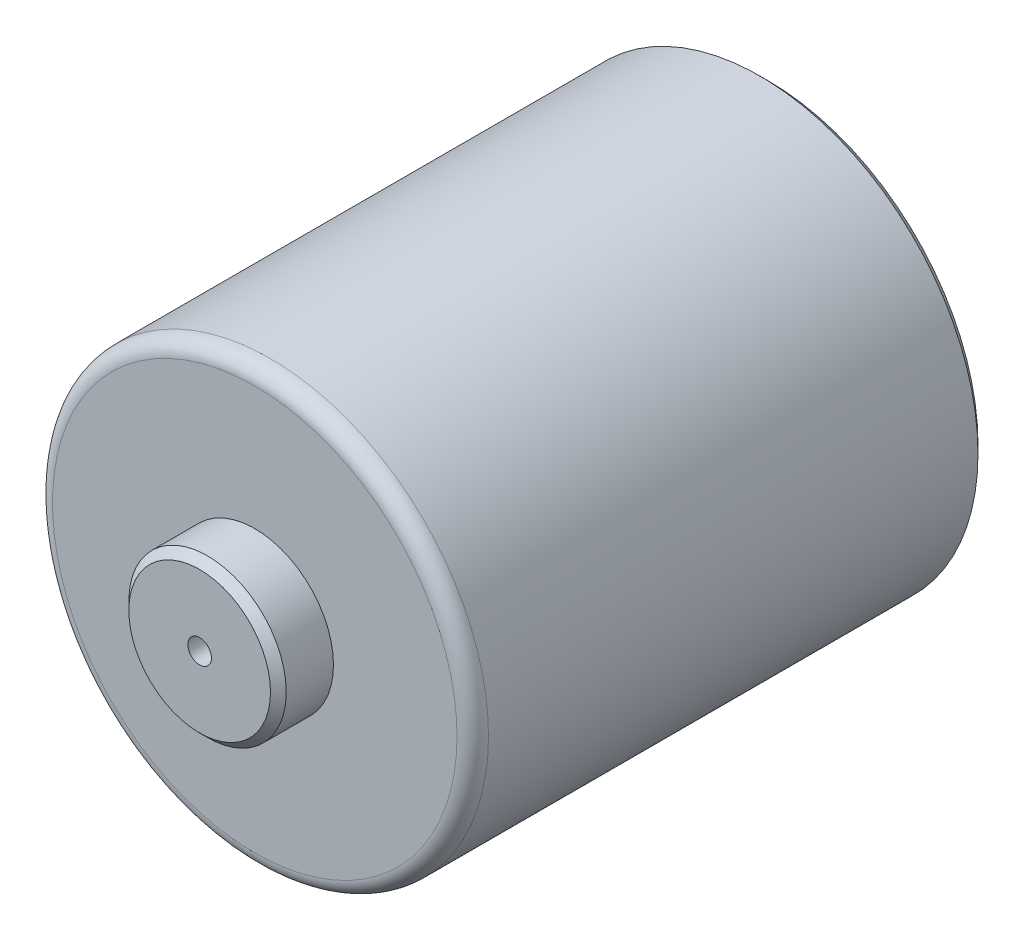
ISO-10303-21;
HEADER;
FILE_DESCRIPTION(('STEP AP214'),'2;1');
FILE_NAME('part.step','',(''),(''),'','','');
FILE_SCHEMA(('AUTOMOTIVE_DESIGN { 1 0 10303 214 1 1 1 1 }'));
ENDSEC;
DATA;
#1=APPLICATION_CONTEXT('core data for automotive mechanical design processes');
#2=APPLICATION_PROTOCOL_DEFINITION('international standard','automotive_design',2000,#1);
#3=PRODUCT_CONTEXT('',#1,'mechanical');
#4=PRODUCT('Part','Part','',(#3));
#5=PRODUCT_RELATED_PRODUCT_CATEGORY('part','',(#4));
#6=PRODUCT_DEFINITION_FORMATION('','',#4);
#7=PRODUCT_DEFINITION_CONTEXT('part definition',#1,'design');
#8=PRODUCT_DEFINITION('design','',#6,#7);
#9=PRODUCT_DEFINITION_SHAPE('','',#8);
#10=(LENGTH_UNIT() NAMED_UNIT(*) SI_UNIT(.MILLI.,.METRE.));
#11=(NAMED_UNIT(*) PLANE_ANGLE_UNIT() SI_UNIT($,.RADIAN.));
#12=(NAMED_UNIT(*) SI_UNIT($,.STERADIAN.) SOLID_ANGLE_UNIT());
#13=UNCERTAINTY_MEASURE_WITH_UNIT(LENGTH_MEASURE(1.E-05),#10,'distance_accuracy_value','');
#14=(GEOMETRIC_REPRESENTATION_CONTEXT(3) GLOBAL_UNCERTAINTY_ASSIGNED_CONTEXT((#13)) GLOBAL_UNIT_ASSIGNED_CONTEXT((#10,
#11,#12)) REPRESENTATION_CONTEXT('',''));
#15=CARTESIAN_POINT('',(0.,0.,0.));
#16=DIRECTION('',(0.,0.,1.));
#17=DIRECTION('',(1.,0.,0.));
#18=AXIS2_PLACEMENT_3D('',#15,#16,#17);
#19=CARTESIAN_POINT('',(0.,0.,0.));
#20=DIRECTION('',(0.,0.,1.));
#21=DIRECTION('',(1.,0.,0.));
#22=AXIS2_PLACEMENT_3D('',#19,#20,#21);
#23=PLANE('',#22);
#24=CARTESIAN_POINT('',(0.,0.,0.));
#25=DIRECTION('',(0.,0.,1.));
#26=DIRECTION('',(1.,0.,0.));
#27=AXIS2_PLACEMENT_3D('',#24,#25,#26);
#28=CIRCLE('',#27,13.35);
#29=CARTESIAN_POINT('',(13.35,0.,0.));
#30=VERTEX_POINT('',#29);
#31=EDGE_CURVE('E50',#30,#30,#28,.F.);
#32=ORIENTED_EDGE('',*,*,#31,.T.);
#33=EDGE_LOOP('',(#32));
#34=FACE_BOUND('',#33,.T.);
#35=CARTESIAN_POINT('',(0.,0.,0.));
#36=DIRECTION('',(0.,0.,1.));
#37=DIRECTION('',(1.,0.,0.));
#38=AXIS2_PLACEMENT_3D('',#35,#36,#37);
#39=CIRCLE('',#38,5.);
#40=CARTESIAN_POINT('',(5.,0.,0.));
#41=VERTEX_POINT('',#40);
#42=EDGE_CURVE('E62',#41,#41,#39,.F.);
#43=ORIENTED_EDGE('',*,*,#42,.F.);
#44=EDGE_LOOP('',(#43));
#45=FACE_BOUND('',#44,.T.);
#46=ADVANCED_FACE('F30',(#34,#45),#23,.F.);
#47=CARTESIAN_POINT('',(0.,0.,32.6));
#48=DIRECTION('',(0.,0.,1.));
#49=DIRECTION('',(1.,0.,0.));
#50=AXIS2_PLACEMENT_3D('',#47,#48,#49);
#51=PLANE('',#50);
#52=CARTESIAN_POINT('',(0.,0.,32.6));
#53=DIRECTION('',(0.,0.,1.));
#54=DIRECTION('',(1.,0.,0.));
#55=AXIS2_PLACEMENT_3D('',#52,#53,#54);
#56=CIRCLE('',#55,12.85);
#57=CARTESIAN_POINT('',(12.85,0.,32.6));
#58=VERTEX_POINT('',#57);
#59=EDGE_CURVE('E37',#58,#58,#56,.T.);
#60=ORIENTED_EDGE('',*,*,#59,.T.);
#61=EDGE_LOOP('',(#60));
#62=FACE_BOUND('',#61,.T.);
#63=CARTESIAN_POINT('',(0.,0.,32.6));
#64=DIRECTION('',(0.,0.,1.));
#65=DIRECTION('',(1.,0.,0.));
#66=AXIS2_PLACEMENT_3D('',#63,#64,#65);
#67=CIRCLE('',#66,5.);
#68=CARTESIAN_POINT('',(5.,0.,32.6));
#69=VERTEX_POINT('',#68);
#70=EDGE_CURVE('E65',#69,#69,#67,.T.);
#71=ORIENTED_EDGE('',*,*,#70,.F.);
#72=EDGE_LOOP('',(#71));
#73=FACE_BOUND('',#72,.T.);
#74=ADVANCED_FACE('F102',(#62,#73),#51,.T.);
#75=CARTESIAN_POINT('',(0.,0.,32.6));
#76=DIRECTION('',(0.,0.,-1.));
#77=DIRECTION('',(-1.,0.,0.));
#78=AXIS2_PLACEMENT_3D('',#75,#76,#77);
#79=CYLINDRICAL_SURFACE('',#78,13.85);
#80=CARTESIAN_POINT('',(0.,0.,31.6));
#81=DIRECTION('',(0.,0.,1.));
#82=DIRECTION('',(1.,0.,0.));
#83=AXIS2_PLACEMENT_3D('',#80,#81,#82);
#84=CIRCLE('',#83,13.85);
#85=CARTESIAN_POINT('',(13.85,0.,31.6));
#86=VERTEX_POINT('',#85);
#87=EDGE_CURVE('E10',#86,#86,#84,.F.);
#88=ORIENTED_EDGE('',*,*,#87,.T.);
#89=EDGE_LOOP('',(#88));
#90=FACE_BOUND('',#89,.T.);
#91=CARTESIAN_POINT('',(0.,0.,0.500000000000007));
#92=DIRECTION('',(0.,0.,1.));
#93=DIRECTION('',(1.,0.,0.));
#94=AXIS2_PLACEMENT_3D('',#91,#92,#93);
#95=CIRCLE('',#94,13.85);
#96=CARTESIAN_POINT('',(13.85,0.,0.500000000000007));
#97=VERTEX_POINT('',#96);
#98=EDGE_CURVE('E53',#97,#97,#95,.T.);
#99=ORIENTED_EDGE('',*,*,#98,.T.);
#100=EDGE_LOOP('',(#99));
#101=FACE_BOUND('',#100,.T.);
#102=ADVANCED_FACE('F32',(#90,#101),#79,.T.);
#103=CARTESIAN_POINT('',(0.,0.,36.1));
#104=DIRECTION('',(0.,0.,-1.));
#105=DIRECTION('',(-1.,0.,0.));
#106=AXIS2_PLACEMENT_3D('',#103,#104,#105);
#107=CYLINDRICAL_SURFACE('',#106,5.);
#108=CARTESIAN_POINT('',(0.,0.,35.6));
#109=DIRECTION('',(0.,0.,1.));
#110=DIRECTION('',(1.,0.,0.));
#111=AXIS2_PLACEMENT_3D('',#108,#109,#110);
#112=CIRCLE('',#111,5.);
#113=CARTESIAN_POINT('',(5.,0.,35.6));
#114=VERTEX_POINT('',#113);
#115=EDGE_CURVE('E41',#114,#114,#112,.F.);
#116=ORIENTED_EDGE('',*,*,#115,.T.);
#117=EDGE_LOOP('',(#116));
#118=FACE_BOUND('',#117,.T.);
#119=ORIENTED_EDGE('',*,*,#70,.T.);
#120=EDGE_LOOP('',(#119));
#121=FACE_BOUND('',#120,.T.);
#122=ADVANCED_FACE('F81',(#118,#121),#107,.T.);
#123=CARTESIAN_POINT('',(0.,0.,36.1));
#124=DIRECTION('',(0.,0.,1.));
#125=DIRECTION('',(1.,0.,0.));
#126=AXIS2_PLACEMENT_3D('',#123,#124,#125);
#127=PLANE('',#126);
#128=CARTESIAN_POINT('',(0.,0.,36.1));
#129=DIRECTION('',(0.,0.,1.));
#130=DIRECTION('',(1.,0.,0.));
#131=AXIS2_PLACEMENT_3D('',#128,#129,#130);
#132=CIRCLE('',#131,0.75);
#133=CARTESIAN_POINT('',(0.75,0.,36.1));
#134=VERTEX_POINT('',#133);
#135=EDGE_CURVE('E71',#134,#134,#132,.T.);
#136=ORIENTED_EDGE('',*,*,#135,.F.);
#137=EDGE_LOOP('',(#136));
#138=FACE_BOUND('',#137,.T.);
#139=CARTESIAN_POINT('',(0.,0.,36.1));
#140=DIRECTION('',(0.,0.,1.));
#141=DIRECTION('',(1.,0.,0.));
#142=AXIS2_PLACEMENT_3D('',#139,#140,#141);
#143=CIRCLE('',#142,4.49999999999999);
#144=CARTESIAN_POINT('',(4.49999999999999,0.,36.1));
#145=VERTEX_POINT('',#144);
#146=EDGE_CURVE('E45',#145,#145,#143,.T.);
#147=ORIENTED_EDGE('',*,*,#146,.T.);
#148=EDGE_LOOP('',(#147));
#149=FACE_BOUND('',#148,.T.);
#150=ADVANCED_FACE('F77',(#138,#149),#127,.T.);
#151=CARTESIAN_POINT('',(0.,0.,-2.2));
#152=DIRECTION('',(0.,0.,1.));
#153=DIRECTION('',(1.,0.,0.));
#154=AXIS2_PLACEMENT_3D('',#151,#152,#153);
#155=CYLINDRICAL_SURFACE('',#154,5.);
#156=CARTESIAN_POINT('',(0.,0.,-1.69999999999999));
#157=DIRECTION('',(0.,0.,-1.));
#158=DIRECTION('',(-1.,0.,0.));
#159=AXIS2_PLACEMENT_3D('',#156,#157,#158);
#160=CIRCLE('',#159,5.);
#161=CARTESIAN_POINT('',(-5.,0.,-1.69999999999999));
#162=VERTEX_POINT('',#161);
#163=EDGE_CURVE('E56',#162,#162,#160,.F.);
#164=ORIENTED_EDGE('',*,*,#163,.T.);
#165=EDGE_LOOP('',(#164));
#166=FACE_BOUND('',#165,.T.);
#167=ORIENTED_EDGE('',*,*,#42,.T.);
#168=EDGE_LOOP('',(#167));
#169=FACE_BOUND('',#168,.T.);
#170=ADVANCED_FACE('F80',(#166,#169),#155,.T.);
#171=CARTESIAN_POINT('',(0.,0.,-2.2));
#172=DIRECTION('',(0.,0.,-1.));
#173=DIRECTION('',(-1.,0.,0.));
#174=AXIS2_PLACEMENT_3D('',#171,#172,#173);
#175=PLANE('',#174);
#176=CARTESIAN_POINT('',(0.,0.,-2.2));
#177=DIRECTION('',(0.,0.,1.));
#178=DIRECTION('',(1.,0.,0.));
#179=AXIS2_PLACEMENT_3D('',#176,#177,#178);
#180=CIRCLE('',#179,0.75);
#181=CARTESIAN_POINT('',(0.75,0.,-2.2));
#182=VERTEX_POINT('',#181);
#183=EDGE_CURVE('E68',#182,#182,#180,.T.);
#184=ORIENTED_EDGE('',*,*,#183,.T.);
#185=EDGE_LOOP('',(#184));
#186=FACE_BOUND('',#185,.T.);
#187=CARTESIAN_POINT('',(0.,0.,-2.2));
#188=DIRECTION('',(0.,0.,-1.));
#189=DIRECTION('',(-1.,0.,0.));
#190=AXIS2_PLACEMENT_3D('',#187,#188,#189);
#191=CIRCLE('',#190,4.49999999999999);
#192=CARTESIAN_POINT('',(-4.49999999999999,0.,-2.2));
#193=VERTEX_POINT('',#192);
#194=EDGE_CURVE('E59',#193,#193,#191,.T.);
#195=ORIENTED_EDGE('',*,*,#194,.T.);
#196=EDGE_LOOP('',(#195));
#197=FACE_BOUND('',#196,.T.);
#198=ADVANCED_FACE('F115',(#186,#197),#175,.T.);
#199=CARTESIAN_POINT('',(0.,0.,-2.2));
#200=DIRECTION('',(0.,0.,1.));
#201=DIRECTION('',(1.,0.,0.));
#202=AXIS2_PLACEMENT_3D('',#199,#200,#201);
#203=CONICAL_SURFACE('',#202,4.49999999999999,0.785398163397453);
#204=ORIENTED_EDGE('',*,*,#163,.F.);
#205=EDGE_LOOP('',(#204));
#206=FACE_BOUND('',#205,.T.);
#207=ORIENTED_EDGE('',*,*,#194,.F.);
#208=EDGE_LOOP('',(#207));
#209=FACE_BOUND('',#208,.T.);
#210=ADVANCED_FACE('F97',(#206,#209),#203,.T.);
#211=CARTESIAN_POINT('',(0.,0.,0.500000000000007));
#212=DIRECTION('',(0.,0.,1.));
#213=DIRECTION('',(1.,0.,0.));
#214=AXIS2_PLACEMENT_3D('',#211,#212,#213);
#215=CONICAL_SURFACE('',#214,13.85,0.785398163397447);
#216=ORIENTED_EDGE('',*,*,#31,.F.);
#217=EDGE_LOOP('',(#216));
#218=FACE_BOUND('',#217,.T.);
#219=ORIENTED_EDGE('',*,*,#98,.F.);
#220=EDGE_LOOP('',(#219));
#221=FACE_BOUND('',#220,.T.);
#222=ADVANCED_FACE('F88',(#218,#221),#215,.T.);
#223=CARTESIAN_POINT('',(0.,0.,36.1));
#224=DIRECTION('',(0.,0.,-1.));
#225=DIRECTION('',(-1.,0.,0.));
#226=AXIS2_PLACEMENT_3D('',#223,#224,#225);
#227=CONICAL_SURFACE('',#226,4.49999999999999,0.785398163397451);
#228=ORIENTED_EDGE('',*,*,#115,.F.);
#229=EDGE_LOOP('',(#228));
#230=FACE_BOUND('',#229,.T.);
#231=ORIENTED_EDGE('',*,*,#146,.F.);
#232=EDGE_LOOP('',(#231));
#233=FACE_BOUND('',#232,.T.);
#234=ADVANCED_FACE('F85',(#230,#233),#227,.T.);
#235=CARTESIAN_POINT('',(0.,0.,31.6));
#236=DIRECTION('',(0.,0.,1.));
#237=DIRECTION('',(1.,0.,0.));
#238=AXIS2_PLACEMENT_3D('',#235,#236,#237);
#239=TOROIDAL_SURFACE('',#238,12.85,1.);
#240=ORIENTED_EDGE('',*,*,#87,.F.);
#241=EDGE_LOOP('',(#240));
#242=FACE_BOUND('',#241,.T.);
#243=ORIENTED_EDGE('',*,*,#59,.F.);
#244=EDGE_LOOP('',(#243));
#245=FACE_BOUND('',#244,.T.);
#246=ADVANCED_FACE('F87',(#242,#245),#239,.T.);
#247=CARTESIAN_POINT('',(0.,0.,-2.2));
#248=DIRECTION('',(0.,0.,1.));
#249=DIRECTION('',(1.,0.,0.));
#250=AXIS2_PLACEMENT_3D('',#247,#248,#249);
#251=CYLINDRICAL_SURFACE('',#250,0.75);
#252=ORIENTED_EDGE('',*,*,#183,.F.);
#253=EDGE_LOOP('',(#252));
#254=FACE_BOUND('',#253,.T.);
#255=ORIENTED_EDGE('',*,*,#135,.T.);
#256=EDGE_LOOP('',(#255));
#257=FACE_BOUND('',#256,.T.);
#258=ADVANCED_FACE('F75',(#254,#257),#251,.F.);
#259=CLOSED_SHELL('',(#46,#74,#102,#122,#150,#170,#198,#210,#222,#234,#246,#258));
#260=MANIFOLD_SOLID_BREP('B2',#259);
#261=ADVANCED_BREP_SHAPE_REPRESENTATION('',(#18,#260),#14);
#262=SHAPE_DEFINITION_REPRESENTATION(#9,#261);
ENDSEC;
END-ISO-10303-21;
